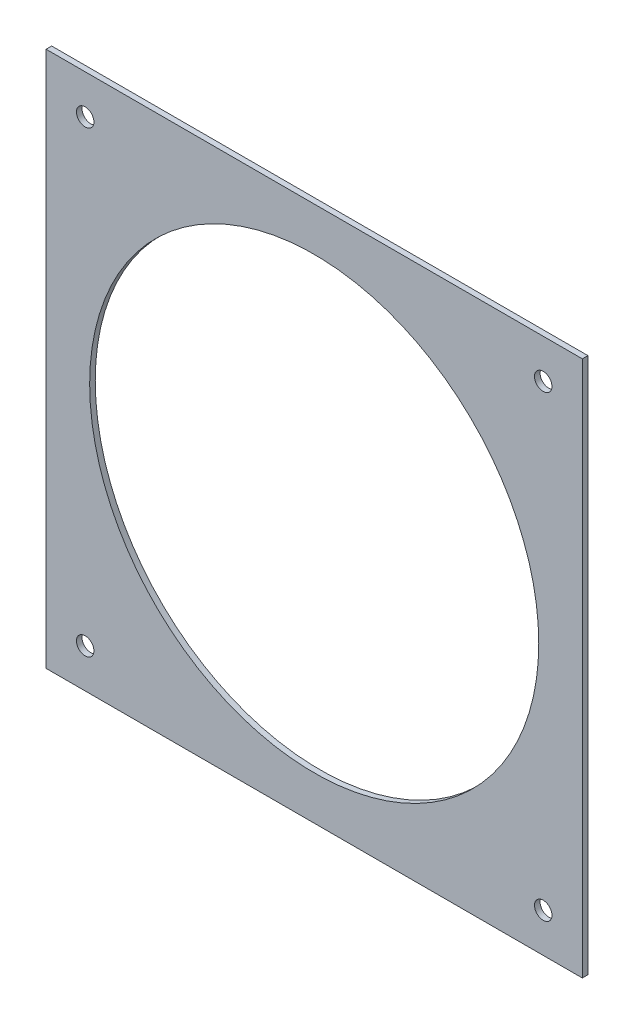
ISO-10303-21;
HEADER;
FILE_DESCRIPTION(('STEP AP214'),'2;1');
FILE_NAME('part.step','',(''),(''),'','','');
FILE_SCHEMA(('AUTOMOTIVE_DESIGN { 1 0 10303 214 1 1 1 1 }'));
ENDSEC;
DATA;
#1=APPLICATION_CONTEXT('core data for automotive mechanical design processes');
#2=APPLICATION_PROTOCOL_DEFINITION('international standard','automotive_design',2000,#1);
#3=PRODUCT_CONTEXT('',#1,'mechanical');
#4=PRODUCT('Part','Part','',(#3));
#5=PRODUCT_RELATED_PRODUCT_CATEGORY('part','',(#4));
#6=PRODUCT_DEFINITION_FORMATION('','',#4);
#7=PRODUCT_DEFINITION_CONTEXT('part definition',#1,'design');
#8=PRODUCT_DEFINITION('design','',#6,#7);
#9=PRODUCT_DEFINITION_SHAPE('','',#8);
#10=(LENGTH_UNIT() NAMED_UNIT(*) SI_UNIT(.MILLI.,.METRE.));
#11=(NAMED_UNIT(*) PLANE_ANGLE_UNIT() SI_UNIT($,.RADIAN.));
#12=(NAMED_UNIT(*) SI_UNIT($,.STERADIAN.) SOLID_ANGLE_UNIT());
#13=UNCERTAINTY_MEASURE_WITH_UNIT(LENGTH_MEASURE(1.E-05),#10,'distance_accuracy_value','');
#14=(GEOMETRIC_REPRESENTATION_CONTEXT(3) GLOBAL_UNCERTAINTY_ASSIGNED_CONTEXT((#13)) GLOBAL_UNIT_ASSIGNED_CONTEXT((#10,
#11,#12)) REPRESENTATION_CONTEXT('',''));
#15=CARTESIAN_POINT('',(0.,0.,0.));
#16=DIRECTION('',(0.,0.,1.));
#17=DIRECTION('',(1.,0.,0.));
#18=AXIS2_PLACEMENT_3D('',#15,#16,#17);
#19=CARTESIAN_POINT('',(0.,0.,3.175));
#20=DIRECTION('',(0.,0.,-1.));
#21=DIRECTION('',(-1.,0.,0.));
#22=AXIS2_PLACEMENT_3D('',#19,#20,#21);
#23=PLANE('',#22);
#24=CARTESIAN_POINT('',(22.225,22.225,3.175));
#25=DIRECTION('',(0.,0.,1.));
#26=DIRECTION('',(1.,0.,0.));
#27=AXIS2_PLACEMENT_3D('',#24,#25,#26);
#28=CIRCLE('',#27,4.96100099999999);
#29=CARTESIAN_POINT('',(27.186001,22.225,3.175));
#30=VERTEX_POINT('',#29);
#31=EDGE_CURVE('E141',#30,#30,#28,.T.);
#32=ORIENTED_EDGE('',*,*,#31,.F.);
#33=EDGE_LOOP('',(#32));
#34=FACE_BOUND('',#33,.T.);
#35=CARTESIAN_POINT('',(282.575,22.225,3.175));
#36=DIRECTION('',(0.,0.,1.));
#37=DIRECTION('',(1.,0.,0.));
#38=AXIS2_PLACEMENT_3D('',#35,#36,#37);
#39=CIRCLE('',#38,4.96100099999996);
#40=CARTESIAN_POINT('',(287.536001,22.225,3.175));
#41=VERTEX_POINT('',#40);
#42=EDGE_CURVE('E135',#41,#41,#39,.T.);
#43=ORIENTED_EDGE('',*,*,#42,.F.);
#44=EDGE_LOOP('',(#43));
#45=FACE_BOUND('',#44,.T.);
#46=CARTESIAN_POINT('',(282.575,282.575,3.175));
#47=DIRECTION('',(0.,0.,1.));
#48=DIRECTION('',(1.,0.,0.));
#49=AXIS2_PLACEMENT_3D('',#46,#47,#48);
#50=CIRCLE('',#49,4.96100099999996);
#51=CARTESIAN_POINT('',(287.536001,282.575,3.175));
#52=VERTEX_POINT('',#51);
#53=EDGE_CURVE('E129',#52,#52,#50,.T.);
#54=ORIENTED_EDGE('',*,*,#53,.F.);
#55=EDGE_LOOP('',(#54));
#56=FACE_BOUND('',#55,.T.);
#57=CARTESIAN_POINT('',(22.225,282.575,3.175));
#58=DIRECTION('',(0.,0.,1.));
#59=DIRECTION('',(1.,0.,0.));
#60=AXIS2_PLACEMENT_3D('',#57,#58,#59);
#61=CIRCLE('',#60,4.96100099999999);
#62=CARTESIAN_POINT('',(27.186001,282.575,3.175));
#63=VERTEX_POINT('',#62);
#64=EDGE_CURVE('E123',#63,#63,#61,.T.);
#65=ORIENTED_EDGE('',*,*,#64,.F.);
#66=EDGE_LOOP('',(#65));
#67=FACE_BOUND('',#66,.T.);
#68=DIRECTION('',(0.,-1.,0.));
#69=VECTOR('',#68,1.);
#70=CARTESIAN_POINT('',(0.,0.,3.175));
#71=LINE('',#70,#69);
#72=CARTESIAN_POINT('',(0.,304.8,3.175));
#73=VERTEX_POINT('',#72);
#74=CARTESIAN_POINT('',(0.,0.,3.175));
#75=VERTEX_POINT('',#74);
#76=EDGE_CURVE('E88',#73,#75,#71,.T.);
#77=ORIENTED_EDGE('',*,*,#76,.T.);
#78=DIRECTION('',(1.,0.,0.));
#79=VECTOR('',#78,1.);
#80=CARTESIAN_POINT('',(0.,0.,3.175));
#81=LINE('',#80,#79);
#82=CARTESIAN_POINT('',(304.8,0.,3.175));
#83=VERTEX_POINT('',#82);
#84=EDGE_CURVE('E83',#75,#83,#81,.T.);
#85=ORIENTED_EDGE('',*,*,#84,.T.);
#86=DIRECTION('',(0.,1.,0.));
#87=VECTOR('',#86,1.);
#88=CARTESIAN_POINT('',(304.8,0.,3.175));
#89=LINE('',#88,#87);
#90=CARTESIAN_POINT('',(304.8,304.8,3.175));
#91=VERTEX_POINT('',#90);
#92=EDGE_CURVE('E86',#83,#91,#89,.T.);
#93=ORIENTED_EDGE('',*,*,#92,.T.);
#94=DIRECTION('',(-1.,0.,0.));
#95=VECTOR('',#94,1.);
#96=CARTESIAN_POINT('',(0.,304.8,3.175));
#97=LINE('',#96,#95);
#98=EDGE_CURVE('E53',#91,#73,#97,.T.);
#99=ORIENTED_EDGE('',*,*,#98,.T.);
#100=EDGE_LOOP('',(#77,#85,#93,#99));
#101=FACE_BOUND('',#100,.T.);
#102=CARTESIAN_POINT('',(152.4,152.4,3.175));
#103=DIRECTION('',(0.,0.,1.));
#104=DIRECTION('',(1.,0.,0.));
#105=AXIS2_PLACEMENT_3D('',#102,#103,#104);
#106=CIRCLE('',#105,127.635);
#107=CARTESIAN_POINT('',(280.035,152.4,3.175));
#108=VERTEX_POINT('',#107);
#109=EDGE_CURVE('E103',#108,#108,#106,.T.);
#110=ORIENTED_EDGE('',*,*,#109,.F.);
#111=EDGE_LOOP('',(#110));
#112=FACE_BOUND('',#111,.T.);
#113=ADVANCED_FACE('F36',(#34,#45,#56,#67,#101,#112),#23,.F.);
#114=CARTESIAN_POINT('',(0.,0.,0.));
#115=DIRECTION('',(0.,0.,-1.));
#116=DIRECTION('',(-1.,0.,0.));
#117=AXIS2_PLACEMENT_3D('',#114,#115,#116);
#118=PLANE('',#117);
#119=CARTESIAN_POINT('',(22.225,22.225,0.));
#120=DIRECTION('',(0.,0.,1.));
#121=DIRECTION('',(1.,0.,0.));
#122=AXIS2_PLACEMENT_3D('',#119,#120,#121);
#123=CIRCLE('',#122,4.961001);
#124=CARTESIAN_POINT('',(27.186001,22.225,0.));
#125=VERTEX_POINT('',#124);
#126=EDGE_CURVE('E138',#125,#125,#123,.T.);
#127=ORIENTED_EDGE('',*,*,#126,.T.);
#128=EDGE_LOOP('',(#127));
#129=FACE_BOUND('',#128,.T.);
#130=CARTESIAN_POINT('',(282.575,22.225,0.));
#131=DIRECTION('',(0.,0.,1.));
#132=DIRECTION('',(1.,0.,0.));
#133=AXIS2_PLACEMENT_3D('',#130,#131,#132);
#134=CIRCLE('',#133,4.96100100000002);
#135=CARTESIAN_POINT('',(287.536001,22.225,0.));
#136=VERTEX_POINT('',#135);
#137=EDGE_CURVE('E132',#136,#136,#134,.T.);
#138=ORIENTED_EDGE('',*,*,#137,.T.);
#139=EDGE_LOOP('',(#138));
#140=FACE_BOUND('',#139,.T.);
#141=CARTESIAN_POINT('',(282.575,282.575,0.));
#142=DIRECTION('',(0.,0.,1.));
#143=DIRECTION('',(1.,0.,0.));
#144=AXIS2_PLACEMENT_3D('',#141,#142,#143);
#145=CIRCLE('',#144,4.96100100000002);
#146=CARTESIAN_POINT('',(287.536001,282.575,0.));
#147=VERTEX_POINT('',#146);
#148=EDGE_CURVE('E126',#147,#147,#145,.T.);
#149=ORIENTED_EDGE('',*,*,#148,.T.);
#150=EDGE_LOOP('',(#149));
#151=FACE_BOUND('',#150,.T.);
#152=CARTESIAN_POINT('',(22.225,282.575,0.));
#153=DIRECTION('',(0.,0.,1.));
#154=DIRECTION('',(1.,0.,0.));
#155=AXIS2_PLACEMENT_3D('',#152,#153,#154);
#156=CIRCLE('',#155,4.961001);
#157=CARTESIAN_POINT('',(27.186001,282.575,0.));
#158=VERTEX_POINT('',#157);
#159=EDGE_CURVE('E118',#158,#158,#156,.T.);
#160=ORIENTED_EDGE('',*,*,#159,.T.);
#161=EDGE_LOOP('',(#160));
#162=FACE_BOUND('',#161,.T.);
#163=DIRECTION('',(0.,-1.,0.));
#164=VECTOR('',#163,1.);
#165=CARTESIAN_POINT('',(0.,0.,0.));
#166=LINE('',#165,#164);
#167=CARTESIAN_POINT('',(0.,304.8,0.));
#168=VERTEX_POINT('',#167);
#169=CARTESIAN_POINT('',(0.,0.,0.));
#170=VERTEX_POINT('',#169);
#171=EDGE_CURVE('E100',#168,#170,#166,.T.);
#172=ORIENTED_EDGE('',*,*,#171,.F.);
#173=DIRECTION('',(-1.,0.,0.));
#174=VECTOR('',#173,1.);
#175=CARTESIAN_POINT('',(0.,304.8,0.));
#176=LINE('',#175,#174);
#177=CARTESIAN_POINT('',(304.8,304.8,0.));
#178=VERTEX_POINT('',#177);
#179=EDGE_CURVE('E76',#178,#168,#176,.T.);
#180=ORIENTED_EDGE('',*,*,#179,.F.);
#181=DIRECTION('',(0.,1.,0.));
#182=VECTOR('',#181,1.);
#183=CARTESIAN_POINT('',(304.8,0.,0.));
#184=LINE('',#183,#182);
#185=CARTESIAN_POINT('',(304.8,0.,0.));
#186=VERTEX_POINT('',#185);
#187=EDGE_CURVE('E70',#186,#178,#184,.T.);
#188=ORIENTED_EDGE('',*,*,#187,.F.);
#189=DIRECTION('',(1.,0.,0.));
#190=VECTOR('',#189,1.);
#191=CARTESIAN_POINT('',(0.,0.,0.));
#192=LINE('',#191,#190);
#193=EDGE_CURVE('E92',#170,#186,#192,.T.);
#194=ORIENTED_EDGE('',*,*,#193,.F.);
#195=EDGE_LOOP('',(#172,#180,#188,#194));
#196=FACE_BOUND('',#195,.T.);
#197=CARTESIAN_POINT('',(152.4,152.4,0.));
#198=DIRECTION('',(0.,0.,1.));
#199=DIRECTION('',(1.,0.,0.));
#200=AXIS2_PLACEMENT_3D('',#197,#198,#199);
#201=CIRCLE('',#200,127.635);
#202=CARTESIAN_POINT('',(280.035,152.4,0.));
#203=VERTEX_POINT('',#202);
#204=EDGE_CURVE('E115',#203,#203,#201,.T.);
#205=ORIENTED_EDGE('',*,*,#204,.T.);
#206=EDGE_LOOP('',(#205));
#207=FACE_BOUND('',#206,.T.);
#208=ADVANCED_FACE('F111',(#129,#140,#151,#162,#196,#207),#118,.T.);
#209=CARTESIAN_POINT('',(0.,0.,3.175));
#210=DIRECTION('',(1.,0.,0.));
#211=DIRECTION('',(0.,0.,-1.));
#212=AXIS2_PLACEMENT_3D('',#209,#210,#211);
#213=PLANE('',#212);
#214=ORIENTED_EDGE('',*,*,#171,.T.);
#215=DIRECTION('',(0.,0.,-1.));
#216=VECTOR('',#215,1.);
#217=CARTESIAN_POINT('',(0.,0.,3.175));
#218=LINE('',#217,#216);
#219=EDGE_CURVE('E11',#75,#170,#218,.T.);
#220=ORIENTED_EDGE('',*,*,#219,.F.);
#221=ORIENTED_EDGE('',*,*,#76,.F.);
#222=DIRECTION('',(0.,0.,-1.));
#223=VECTOR('',#222,1.);
#224=CARTESIAN_POINT('',(0.,304.8,3.175));
#225=LINE('',#224,#223);
#226=EDGE_CURVE('E96',#73,#168,#225,.T.);
#227=ORIENTED_EDGE('',*,*,#226,.T.);
#228=EDGE_LOOP('',(#214,#220,#221,#227));
#229=FACE_BOUND('',#228,.T.);
#230=ADVANCED_FACE('F38',(#229),#213,.F.);
#231=CARTESIAN_POINT('',(0.,0.,3.175));
#232=DIRECTION('',(0.,1.,0.));
#233=DIRECTION('',(0.,0.,1.));
#234=AXIS2_PLACEMENT_3D('',#231,#232,#233);
#235=PLANE('',#234);
#236=ORIENTED_EDGE('',*,*,#193,.T.);
#237=DIRECTION('',(0.,0.,-1.));
#238=VECTOR('',#237,1.);
#239=CARTESIAN_POINT('',(304.8,0.,3.175));
#240=LINE('',#239,#238);
#241=EDGE_CURVE('E45',#83,#186,#240,.T.);
#242=ORIENTED_EDGE('',*,*,#241,.F.);
#243=ORIENTED_EDGE('',*,*,#84,.F.);
#244=ORIENTED_EDGE('',*,*,#219,.T.);
#245=EDGE_LOOP('',(#236,#242,#243,#244));
#246=FACE_BOUND('',#245,.T.);
#247=ADVANCED_FACE('F91',(#246),#235,.F.);
#248=CARTESIAN_POINT('',(304.8,0.,3.175));
#249=DIRECTION('',(-1.,0.,0.));
#250=DIRECTION('',(0.,-1.,0.));
#251=AXIS2_PLACEMENT_3D('',#248,#249,#250);
#252=PLANE('',#251);
#253=ORIENTED_EDGE('',*,*,#187,.T.);
#254=DIRECTION('',(0.,0.,-1.));
#255=VECTOR('',#254,1.);
#256=CARTESIAN_POINT('',(304.8,304.8,3.175));
#257=LINE('',#256,#255);
#258=EDGE_CURVE('E93',#91,#178,#257,.T.);
#259=ORIENTED_EDGE('',*,*,#258,.F.);
#260=ORIENTED_EDGE('',*,*,#92,.F.);
#261=ORIENTED_EDGE('',*,*,#241,.T.);
#262=EDGE_LOOP('',(#253,#259,#260,#261));
#263=FACE_BOUND('',#262,.T.);
#264=ADVANCED_FACE('F94',(#263),#252,.F.);
#265=CARTESIAN_POINT('',(0.,304.8,3.175));
#266=DIRECTION('',(0.,-1.,0.));
#267=DIRECTION('',(0.,0.,-1.));
#268=AXIS2_PLACEMENT_3D('',#265,#266,#267);
#269=PLANE('',#268);
#270=ORIENTED_EDGE('',*,*,#179,.T.);
#271=ORIENTED_EDGE('',*,*,#226,.F.);
#272=ORIENTED_EDGE('',*,*,#98,.F.);
#273=ORIENTED_EDGE('',*,*,#258,.T.);
#274=EDGE_LOOP('',(#270,#271,#272,#273));
#275=FACE_BOUND('',#274,.T.);
#276=ADVANCED_FACE('F108',(#275),#269,.F.);
#277=CARTESIAN_POINT('',(152.4,152.4,3.175));
#278=DIRECTION('',(0.,0.,-1.));
#279=DIRECTION('',(-1.,0.,0.));
#280=AXIS2_PLACEMENT_3D('',#277,#278,#279);
#281=CYLINDRICAL_SURFACE('',#280,127.635);
#282=ORIENTED_EDGE('',*,*,#109,.T.);
#283=EDGE_LOOP('',(#282));
#284=FACE_BOUND('',#283,.T.);
#285=ORIENTED_EDGE('',*,*,#204,.F.);
#286=EDGE_LOOP('',(#285));
#287=FACE_BOUND('',#286,.T.);
#288=ADVANCED_FACE('F159',(#284,#287),#281,.F.);
#289=CARTESIAN_POINT('',(22.225,282.575,3.175));
#290=DIRECTION('',(0.,0.,1.));
#291=DIRECTION('',(1.,0.,0.));
#292=AXIS2_PLACEMENT_3D('',#289,#290,#291);
#293=CYLINDRICAL_SURFACE('',#292,4.96100099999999);
#294=ORIENTED_EDGE('',*,*,#159,.F.);
#295=EDGE_LOOP('',(#294));
#296=FACE_BOUND('',#295,.T.);
#297=ORIENTED_EDGE('',*,*,#64,.T.);
#298=EDGE_LOOP('',(#297));
#299=FACE_BOUND('',#298,.T.);
#300=ADVANCED_FACE('F156',(#296,#299),#293,.F.);
#301=CARTESIAN_POINT('',(282.575,282.575,3.175));
#302=DIRECTION('',(0.,0.,1.));
#303=DIRECTION('',(1.,0.,0.));
#304=AXIS2_PLACEMENT_3D('',#301,#302,#303);
#305=CYLINDRICAL_SURFACE('',#304,4.96100099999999);
#306=ORIENTED_EDGE('',*,*,#148,.F.);
#307=EDGE_LOOP('',(#306));
#308=FACE_BOUND('',#307,.T.);
#309=ORIENTED_EDGE('',*,*,#53,.T.);
#310=EDGE_LOOP('',(#309));
#311=FACE_BOUND('',#310,.T.);
#312=ADVANCED_FACE('F158',(#308,#311),#305,.F.);
#313=CARTESIAN_POINT('',(282.575,22.225,3.175));
#314=DIRECTION('',(0.,0.,1.));
#315=DIRECTION('',(1.,0.,0.));
#316=AXIS2_PLACEMENT_3D('',#313,#314,#315);
#317=CYLINDRICAL_SURFACE('',#316,4.96100099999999);
#318=ORIENTED_EDGE('',*,*,#137,.F.);
#319=EDGE_LOOP('',(#318));
#320=FACE_BOUND('',#319,.T.);
#321=ORIENTED_EDGE('',*,*,#42,.T.);
#322=EDGE_LOOP('',(#321));
#323=FACE_BOUND('',#322,.T.);
#324=ADVANCED_FACE('F166',(#320,#323),#317,.F.);
#325=CARTESIAN_POINT('',(22.225,22.225,3.175));
#326=DIRECTION('',(0.,0.,1.));
#327=DIRECTION('',(1.,0.,0.));
#328=AXIS2_PLACEMENT_3D('',#325,#326,#327);
#329=CYLINDRICAL_SURFACE('',#328,4.96100099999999);
#330=ORIENTED_EDGE('',*,*,#126,.F.);
#331=EDGE_LOOP('',(#330));
#332=FACE_BOUND('',#331,.T.);
#333=ORIENTED_EDGE('',*,*,#31,.T.);
#334=EDGE_LOOP('',(#333));
#335=FACE_BOUND('',#334,.T.);
#336=ADVANCED_FACE('F145',(#332,#335),#329,.F.);
#337=CLOSED_SHELL('',(#113,#208,#230,#247,#264,#276,#288,#300,#312,#324,#336));
#338=MANIFOLD_SOLID_BREP('B2',#337);
#339=ADVANCED_BREP_SHAPE_REPRESENTATION('',(#18,#338),#14);
#340=SHAPE_DEFINITION_REPRESENTATION(#9,#339);
ENDSEC;
END-ISO-10303-21;
